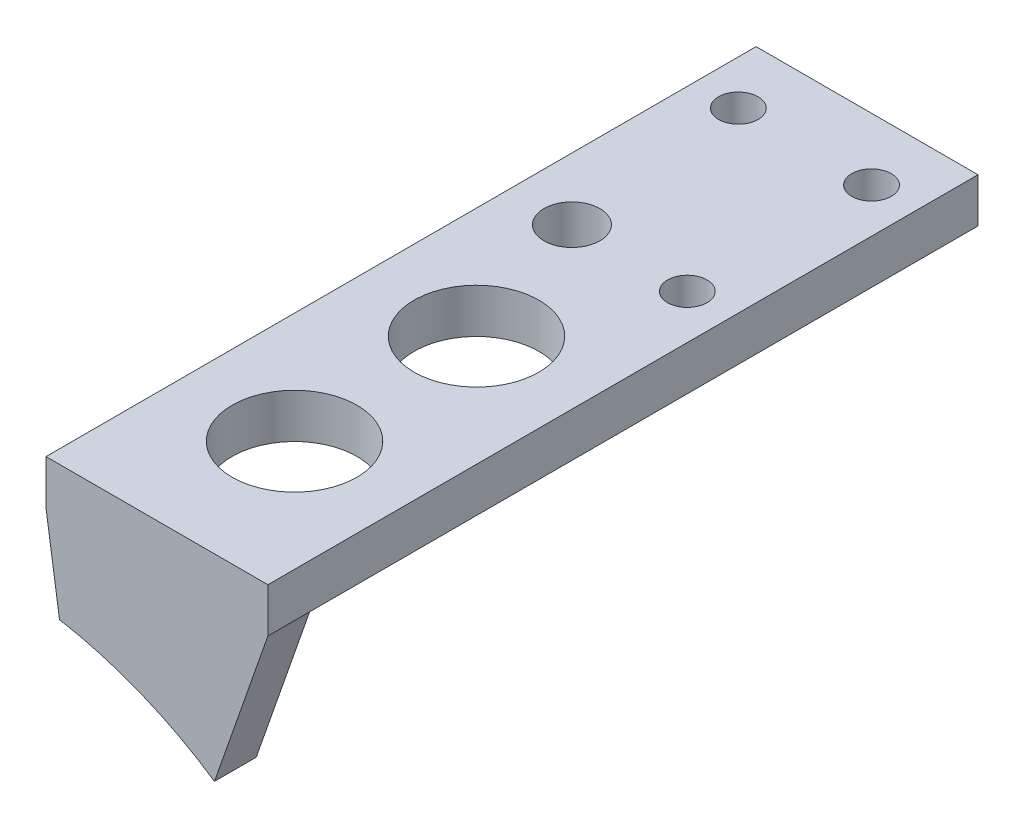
ISO-10303-21;
HEADER;
FILE_DESCRIPTION(('STEP AP214'),'2;1');
FILE_NAME('part.step','',(''),(''),'','','');
FILE_SCHEMA(('AUTOMOTIVE_DESIGN { 1 0 10303 214 1 1 1 1 }'));
ENDSEC;
DATA;
#1=APPLICATION_CONTEXT('core data for automotive mechanical design processes');
#2=APPLICATION_PROTOCOL_DEFINITION('international standard','automotive_design',2000,#1);
#3=PRODUCT_CONTEXT('',#1,'mechanical');
#4=PRODUCT('Part','Part','',(#3));
#5=PRODUCT_RELATED_PRODUCT_CATEGORY('part','',(#4));
#6=PRODUCT_DEFINITION_FORMATION('','',#4);
#7=PRODUCT_DEFINITION_CONTEXT('part definition',#1,'design');
#8=PRODUCT_DEFINITION('design','',#6,#7);
#9=PRODUCT_DEFINITION_SHAPE('','',#8);
#10=(LENGTH_UNIT() NAMED_UNIT(*) SI_UNIT(.MILLI.,.METRE.));
#11=(NAMED_UNIT(*) PLANE_ANGLE_UNIT() SI_UNIT($,.RADIAN.));
#12=(NAMED_UNIT(*) SI_UNIT($,.STERADIAN.) SOLID_ANGLE_UNIT());
#13=UNCERTAINTY_MEASURE_WITH_UNIT(LENGTH_MEASURE(1.E-05),#10,'distance_accuracy_value','');
#14=(GEOMETRIC_REPRESENTATION_CONTEXT(3) GLOBAL_UNCERTAINTY_ASSIGNED_CONTEXT((#13)) GLOBAL_UNIT_ASSIGNED_CONTEXT((#10,
#11,#12)) REPRESENTATION_CONTEXT('',''));
#15=CARTESIAN_POINT('',(0.,0.,0.));
#16=DIRECTION('',(0.,0.,1.));
#17=DIRECTION('',(1.,0.,0.));
#18=AXIS2_PLACEMENT_3D('',#15,#16,#17);
#19=CARTESIAN_POINT('',(-1.88392375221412,12.5594916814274,1.19379999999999));
#20=DIRECTION('',(0.988936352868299,0.148340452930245,0.));
#21=DIRECTION('',(-0.148340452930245,0.988936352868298,0.));
#22=AXIS2_PLACEMENT_3D('',#19,#20,#21);
#23=PLANE('',#22);
#24=DIRECTION('',(0.148340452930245,-0.988936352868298,0.));
#25=VECTOR('',#24,1.);
#26=CARTESIAN_POINT('',(-1.88392375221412,12.5594916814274,-1.19379999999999));
#27=LINE('',#26,#25);
#28=CARTESIAN_POINT('',(-3.81000000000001,25.4,-1.19379999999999));
#29=VERTEX_POINT('',#28);
#30=CARTESIAN_POINT('',(-3.03657,20.2438,-1.19380000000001));
#31=VERTEX_POINT('',#30);
#32=EDGE_CURVE('E137',#29,#31,#27,.T.);
#33=ORIENTED_EDGE('',*,*,#32,.T.);
#34=DIRECTION('',(0.,0.,1.));
#35=VECTOR('',#34,1.);
#36=CARTESIAN_POINT('',(-3.03657,20.2438,-39.4462250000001));
#37=LINE('',#36,#35);
#38=CARTESIAN_POINT('',(-3.03657,20.2438,1.19379999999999));
#39=VERTEX_POINT('',#38);
#40=EDGE_CURVE('E61',#31,#39,#37,.T.);
#41=ORIENTED_EDGE('',*,*,#40,.T.);
#42=DIRECTION('',(0.148340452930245,-0.988936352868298,0.));
#43=VECTOR('',#42,1.);
#44=CARTESIAN_POINT('',(-1.88392375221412,12.5594916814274,1.19379999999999));
#45=LINE('',#44,#43);
#46=CARTESIAN_POINT('',(-3.81000000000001,25.4,1.19379999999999));
#47=VERTEX_POINT('',#46);
#48=EDGE_CURVE('E118',#47,#39,#45,.T.);
#49=ORIENTED_EDGE('',*,*,#48,.F.);
#50=DIRECTION('',(0.,0.,-1.));
#51=VECTOR('',#50,1.);
#52=CARTESIAN_POINT('',(-3.81000000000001,25.4,1.19379999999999));
#53=LINE('',#52,#51);
#54=EDGE_CURVE('E51',#47,#29,#53,.T.);
#55=ORIENTED_EDGE('',*,*,#54,.T.);
#56=EDGE_LOOP('',(#33,#41,#49,#55));
#57=FACE_BOUND('',#56,.T.);
#58=ADVANCED_FACE('F43',(#57),#23,.F.);
#59=CARTESIAN_POINT('',(4.19545039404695,11.9870011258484,1.19379999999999));
#60=DIRECTION('',(-0.943858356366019,0.330350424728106,0.));
#61=DIRECTION('',(-0.330350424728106,-0.943858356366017,0.));
#62=AXIS2_PLACEMENT_3D('',#59,#60,#61);
#63=PLANE('',#62);
#64=DIRECTION('',(0.330350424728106,0.943858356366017,0.));
#65=VECTOR('',#64,1.);
#66=CARTESIAN_POINT('',(4.19545039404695,11.9870011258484,1.19379999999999));
#67=LINE('',#66,#65);
#68=CARTESIAN_POINT('',(5.83184000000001,16.6624,1.19379999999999));
#69=VERTEX_POINT('',#68);
#70=CARTESIAN_POINT('',(8.89,25.4,1.19379999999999));
#71=VERTEX_POINT('',#70);
#72=EDGE_CURVE('E70',#69,#71,#67,.T.);
#73=ORIENTED_EDGE('',*,*,#72,.F.);
#74=DIRECTION('',(0.,0.,1.));
#75=VECTOR('',#74,1.);
#76=CARTESIAN_POINT('',(5.83184000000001,16.6624,-39.4462250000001));
#77=LINE('',#76,#75);
#78=CARTESIAN_POINT('',(5.83184000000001,16.6624,-1.19380000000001));
#79=VERTEX_POINT('',#78);
#80=EDGE_CURVE('E109',#69,#79,#77,.F.);
#81=ORIENTED_EDGE('',*,*,#80,.T.);
#82=DIRECTION('',(0.330350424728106,0.943858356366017,0.));
#83=VECTOR('',#82,1.);
#84=CARTESIAN_POINT('',(4.19545039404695,11.9870011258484,-1.19379999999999));
#85=LINE('',#84,#83);
#86=CARTESIAN_POINT('',(8.89,25.4,-1.19379999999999));
#87=VERTEX_POINT('',#86);
#88=EDGE_CURVE('E129',#79,#87,#85,.T.);
#89=ORIENTED_EDGE('',*,*,#88,.T.);
#90=DIRECTION('',(0.,0.,-1.));
#91=VECTOR('',#90,1.);
#92=CARTESIAN_POINT('',(8.89,25.4,1.19379999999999));
#93=LINE('',#92,#91);
#94=EDGE_CURVE('E122',#71,#87,#93,.T.);
#95=ORIENTED_EDGE('',*,*,#94,.F.);
#96=EDGE_LOOP('',(#73,#81,#89,#95));
#97=FACE_BOUND('',#96,.T.);
#98=ADVANCED_FACE('F120',(#97),#63,.F.);
#99=CARTESIAN_POINT('',(0.,0.,1.19379999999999));
#100=DIRECTION('',(0.,0.,1.));
#101=DIRECTION('',(1.,0.,0.));
#102=AXIS2_PLACEMENT_3D('',#99,#100,#101);
#103=PLANE('',#102);
#104=CARTESIAN_POINT('',(-6.97304437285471,-2.27472058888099,1.19379999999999));
#105=DIRECTION('',(0.,0.,1.));
#106=DIRECTION('',(1.,0.,0.));
#107=AXIS2_PLACEMENT_3D('',#104,#105,#106);
#108=CIRCLE('',#107,22.86);
#109=EDGE_CURVE('E111',#69,#39,#108,.T.);
#110=ORIENTED_EDGE('',*,*,#109,.F.);
#111=ORIENTED_EDGE('',*,*,#72,.T.);
#112=DIRECTION('',(0.,-1.,0.));
#113=VECTOR('',#112,1.);
#114=CARTESIAN_POINT('',(8.89,27.94,1.19379999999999));
#115=LINE('',#114,#113);
#116=CARTESIAN_POINT('',(8.89,27.94,1.19379999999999));
#117=VERTEX_POINT('',#116);
#118=EDGE_CURVE('E155',#117,#71,#115,.T.);
#119=ORIENTED_EDGE('',*,*,#118,.F.);
#120=DIRECTION('',(1.,0.,0.));
#121=VECTOR('',#120,1.);
#122=CARTESIAN_POINT('',(8.89,27.94,1.19379999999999));
#123=LINE('',#122,#121);
#124=CARTESIAN_POINT('',(-3.81000000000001,27.94,1.19379999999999));
#125=VERTEX_POINT('',#124);
#126=EDGE_CURVE('E158',#125,#117,#123,.T.);
#127=ORIENTED_EDGE('',*,*,#126,.F.);
#128=DIRECTION('',(0.,-1.,0.));
#129=VECTOR('',#128,1.);
#130=CARTESIAN_POINT('',(-3.81000000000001,27.94,1.19379999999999));
#131=LINE('',#130,#129);
#132=EDGE_CURVE('E157',#125,#47,#131,.T.);
#133=ORIENTED_EDGE('',*,*,#132,.T.);
#134=ORIENTED_EDGE('',*,*,#48,.T.);
#135=EDGE_LOOP('',(#110,#111,#119,#127,#133,#134));
#136=FACE_BOUND('',#135,.T.);
#137=ADVANCED_FACE('F116',(#136),#103,.T.);
#138=CARTESIAN_POINT('',(0.,0.,-1.19379999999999));
#139=DIRECTION('',(0.,0.,1.));
#140=DIRECTION('',(1.,0.,0.));
#141=AXIS2_PLACEMENT_3D('',#138,#139,#140);
#142=PLANE('',#141);
#143=ORIENTED_EDGE('',*,*,#88,.F.);
#144=CARTESIAN_POINT('',(-6.97304437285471,-2.27472058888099,-1.19379999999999));
#145=DIRECTION('',(0.,0.,1.));
#146=DIRECTION('',(1.,0.,0.));
#147=AXIS2_PLACEMENT_3D('',#144,#145,#146);
#148=CIRCLE('',#147,22.86);
#149=EDGE_CURVE('E11',#79,#31,#148,.T.);
#150=ORIENTED_EDGE('',*,*,#149,.T.);
#151=ORIENTED_EDGE('',*,*,#32,.F.);
#152=DIRECTION('',(-1.,0.,0.));
#153=VECTOR('',#152,1.);
#154=CARTESIAN_POINT('',(-3.81000000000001,25.4,-1.19379999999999));
#155=LINE('',#154,#153);
#156=EDGE_CURVE('E133',#87,#29,#155,.T.);
#157=ORIENTED_EDGE('',*,*,#156,.F.);
#158=EDGE_LOOP('',(#143,#150,#151,#157));
#159=FACE_BOUND('',#158,.T.);
#160=ADVANCED_FACE('F290',(#159),#142,.F.);
#161=CARTESIAN_POINT('',(8.89,25.4,-39.4462000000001));
#162=DIRECTION('',(0.,1.,0.));
#163=DIRECTION('',(0.,0.,1.));
#164=AXIS2_PLACEMENT_3D('',#161,#162,#163);
#165=PLANE('',#164);
#166=CARTESIAN_POINT('',(2.54,25.4,-6.6802));
#167=DIRECTION('',(0.,1.,0.));
#168=DIRECTION('',(0.,0.,1.));
#169=AXIS2_PLACEMENT_3D('',#166,#167,#168);
#170=CIRCLE('',#169,3.571875);
#171=CARTESIAN_POINT('',(2.54,25.4,-3.10832499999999));
#172=VERTEX_POINT('',#171);
#173=EDGE_CURVE('E257',#172,#172,#170,.T.);
#174=ORIENTED_EDGE('',*,*,#173,.T.);
#175=EDGE_LOOP('',(#174));
#176=FACE_BOUND('',#175,.T.);
#177=CARTESIAN_POINT('',(2.54,25.4,-17.0942));
#178=DIRECTION('',(0.,1.,0.));
#179=DIRECTION('',(0.,0.,1.));
#180=AXIS2_PLACEMENT_3D('',#177,#178,#179);
#181=CIRCLE('',#180,3.571875);
#182=CARTESIAN_POINT('',(2.54,25.4,-13.522325));
#183=VERTEX_POINT('',#182);
#184=EDGE_CURVE('E249',#183,#183,#181,.T.);
#185=ORIENTED_EDGE('',*,*,#184,.T.);
#186=EDGE_LOOP('',(#185));
#187=FACE_BOUND('',#186,.T.);
#188=CARTESIAN_POINT('',(6.35000000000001,25.4,-35.8902));
#189=DIRECTION('',(0.,1.,0.));
#190=DIRECTION('',(0.,0.,1.));
#191=AXIS2_PLACEMENT_3D('',#188,#189,#190);
#192=CIRCLE('',#191,1.13029999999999);
#193=CARTESIAN_POINT('',(6.35000000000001,25.4,-34.7599000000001));
#194=VERTEX_POINT('',#193);
#195=EDGE_CURVE('E242',#194,#194,#192,.T.);
#196=ORIENTED_EDGE('',*,*,#195,.T.);
#197=EDGE_LOOP('',(#196));
#198=FACE_BOUND('',#197,.T.);
#199=CARTESIAN_POINT('',(-1.27000000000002,25.4,-35.8902));
#200=DIRECTION('',(0.,1.,0.));
#201=DIRECTION('',(0.,0.,1.));
#202=AXIS2_PLACEMENT_3D('',#199,#200,#201);
#203=CIRCLE('',#202,1.13029999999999);
#204=CARTESIAN_POINT('',(-1.27000000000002,25.4,-34.7599000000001));
#205=VERTEX_POINT('',#204);
#206=EDGE_CURVE('E184',#205,#205,#203,.T.);
#207=ORIENTED_EDGE('',*,*,#206,.T.);
#208=EDGE_LOOP('',(#207));
#209=FACE_BOUND('',#208,.T.);
#210=CARTESIAN_POINT('',(6.35000000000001,25.4,-25.3492));
#211=DIRECTION('',(0.,1.,0.));
#212=DIRECTION('',(0.,0.,1.));
#213=AXIS2_PLACEMENT_3D('',#210,#211,#212);
#214=CIRCLE('',#213,1.13029999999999);
#215=CARTESIAN_POINT('',(6.35000000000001,25.4,-24.2189000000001));
#216=VERTEX_POINT('',#215);
#217=EDGE_CURVE('E233',#216,#216,#214,.T.);
#218=ORIENTED_EDGE('',*,*,#217,.T.);
#219=EDGE_LOOP('',(#218));
#220=FACE_BOUND('',#219,.T.);
#221=CARTESIAN_POINT('',(-0.253999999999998,25.4,-25.3492));
#222=DIRECTION('',(0.,1.,0.));
#223=DIRECTION('',(0.,0.,1.));
#224=AXIS2_PLACEMENT_3D('',#221,#222,#223);
#225=CIRCLE('',#224,1.6002);
#226=CARTESIAN_POINT('',(-0.253999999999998,25.4,-23.749));
#227=VERTEX_POINT('',#226);
#228=EDGE_CURVE('E180',#227,#227,#225,.T.);
#229=ORIENTED_EDGE('',*,*,#228,.T.);
#230=EDGE_LOOP('',(#229));
#231=FACE_BOUND('',#230,.T.);
#232=DIRECTION('',(0.,0.,-1.));
#233=VECTOR('',#232,1.);
#234=CARTESIAN_POINT('',(8.89,25.4,1.19379999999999));
#235=LINE('',#234,#233);
#236=CARTESIAN_POINT('',(8.89,25.4,-39.4462000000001));
#237=VERTEX_POINT('',#236);
#238=EDGE_CURVE('E149',#87,#237,#235,.T.);
#239=ORIENTED_EDGE('',*,*,#238,.F.);
#240=ORIENTED_EDGE('',*,*,#156,.T.);
#241=DIRECTION('',(0.,0.,1.));
#242=VECTOR('',#241,1.);
#243=CARTESIAN_POINT('',(-3.81000000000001,25.4,1.19379999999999));
#244=LINE('',#243,#242);
#245=CARTESIAN_POINT('',(-3.81000000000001,25.4,-39.4462000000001));
#246=VERTEX_POINT('',#245);
#247=EDGE_CURVE('E142',#246,#29,#244,.T.);
#248=ORIENTED_EDGE('',*,*,#247,.F.);
#249=DIRECTION('',(-1.,0.,0.));
#250=VECTOR('',#249,1.);
#251=CARTESIAN_POINT('',(8.89,25.4,-39.4462000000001));
#252=LINE('',#251,#250);
#253=EDGE_CURVE('E148',#237,#246,#252,.T.);
#254=ORIENTED_EDGE('',*,*,#253,.F.);
#255=EDGE_LOOP('',(#239,#240,#248,#254));
#256=FACE_BOUND('',#255,.T.);
#257=ADVANCED_FACE('F182',(#176,#187,#198,#209,#220,#231,#256),#165,.F.);
#258=CARTESIAN_POINT('',(8.89,27.94,1.19379999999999));
#259=DIRECTION('',(-1.,0.,0.));
#260=DIRECTION('',(0.,0.,1.));
#261=AXIS2_PLACEMENT_3D('',#258,#259,#260);
#262=PLANE('',#261);
#263=ORIENTED_EDGE('',*,*,#94,.T.);
#264=ORIENTED_EDGE('',*,*,#238,.T.);
#265=DIRECTION('',(0.,-1.,0.));
#266=VECTOR('',#265,1.);
#267=CARTESIAN_POINT('',(8.89000000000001,27.94,-39.4462000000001));
#268=LINE('',#267,#266);
#269=CARTESIAN_POINT('',(8.89000000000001,27.94,-39.4462000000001));
#270=VERTEX_POINT('',#269);
#271=EDGE_CURVE('E138',#270,#237,#268,.T.);
#272=ORIENTED_EDGE('',*,*,#271,.F.);
#273=DIRECTION('',(0.,0.,-1.));
#274=VECTOR('',#273,1.);
#275=CARTESIAN_POINT('',(8.89,27.94,1.19379999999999));
#276=LINE('',#275,#274);
#277=EDGE_CURVE('E147',#117,#270,#276,.T.);
#278=ORIENTED_EDGE('',*,*,#277,.F.);
#279=ORIENTED_EDGE('',*,*,#118,.T.);
#280=EDGE_LOOP('',(#263,#264,#272,#278,#279));
#281=FACE_BOUND('',#280,.T.);
#282=ADVANCED_FACE('F176',(#281),#262,.F.);
#283=CARTESIAN_POINT('',(8.89000000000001,27.94,-39.4462000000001));
#284=DIRECTION('',(0.,0.,1.));
#285=DIRECTION('',(1.,0.,0.));
#286=AXIS2_PLACEMENT_3D('',#283,#284,#285);
#287=PLANE('',#286);
#288=ORIENTED_EDGE('',*,*,#253,.T.);
#289=DIRECTION('',(0.,-1.,0.));
#290=VECTOR('',#289,1.);
#291=CARTESIAN_POINT('',(-3.81000000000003,27.94,-39.4462000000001));
#292=LINE('',#291,#290);
#293=CARTESIAN_POINT('',(-3.81000000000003,27.94,-39.4462000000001));
#294=VERTEX_POINT('',#293);
#295=EDGE_CURVE('E160',#294,#246,#292,.T.);
#296=ORIENTED_EDGE('',*,*,#295,.F.);
#297=DIRECTION('',(-1.,0.,0.));
#298=VECTOR('',#297,1.);
#299=CARTESIAN_POINT('',(8.89000000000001,27.94,-39.4462000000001));
#300=LINE('',#299,#298);
#301=EDGE_CURVE('E172',#270,#294,#300,.T.);
#302=ORIENTED_EDGE('',*,*,#301,.F.);
#303=ORIENTED_EDGE('',*,*,#271,.T.);
#304=EDGE_LOOP('',(#288,#296,#302,#303));
#305=FACE_BOUND('',#304,.T.);
#306=ADVANCED_FACE('F169',(#305),#287,.F.);
#307=CARTESIAN_POINT('',(-3.81000000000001,27.94,1.19379999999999));
#308=DIRECTION('',(1.,0.,0.));
#309=DIRECTION('',(0.,0.,-1.));
#310=AXIS2_PLACEMENT_3D('',#307,#308,#309);
#311=PLANE('',#310);
#312=ORIENTED_EDGE('',*,*,#247,.T.);
#313=ORIENTED_EDGE('',*,*,#54,.F.);
#314=ORIENTED_EDGE('',*,*,#132,.F.);
#315=DIRECTION('',(0.,0.,1.));
#316=VECTOR('',#315,1.);
#317=CARTESIAN_POINT('',(-3.81000000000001,27.94,1.19379999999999));
#318=LINE('',#317,#316);
#319=EDGE_CURVE('E212',#294,#125,#318,.T.);
#320=ORIENTED_EDGE('',*,*,#319,.F.);
#321=ORIENTED_EDGE('',*,*,#295,.T.);
#322=EDGE_LOOP('',(#312,#313,#314,#320,#321));
#323=FACE_BOUND('',#322,.T.);
#324=ADVANCED_FACE('F210',(#323),#311,.F.);
#325=CARTESIAN_POINT('',(8.89000000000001,27.94,-39.4462000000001));
#326=DIRECTION('',(0.,1.,0.));
#327=DIRECTION('',(0.,0.,1.));
#328=AXIS2_PLACEMENT_3D('',#325,#326,#327);
#329=PLANE('',#328);
#330=CARTESIAN_POINT('',(2.54000000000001,27.94,-6.6802));
#331=DIRECTION('',(0.,1.,0.));
#332=DIRECTION('',(0.,0.,1.));
#333=AXIS2_PLACEMENT_3D('',#330,#331,#332);
#334=CIRCLE('',#333,3.571875);
#335=CARTESIAN_POINT('',(2.54000000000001,27.94,-3.10832499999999));
#336=VERTEX_POINT('',#335);
#337=EDGE_CURVE('E192',#336,#336,#334,.T.);
#338=ORIENTED_EDGE('',*,*,#337,.F.);
#339=EDGE_LOOP('',(#338));
#340=FACE_BOUND('',#339,.T.);
#341=CARTESIAN_POINT('',(2.54000000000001,27.94,-17.0942));
#342=DIRECTION('',(0.,1.,0.));
#343=DIRECTION('',(0.,0.,1.));
#344=AXIS2_PLACEMENT_3D('',#341,#342,#343);
#345=CIRCLE('',#344,3.571875);
#346=CARTESIAN_POINT('',(2.54000000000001,27.94,-13.522325));
#347=VERTEX_POINT('',#346);
#348=EDGE_CURVE('E253',#347,#347,#345,.T.);
#349=ORIENTED_EDGE('',*,*,#348,.F.);
#350=EDGE_LOOP('',(#349));
#351=FACE_BOUND('',#350,.T.);
#352=CARTESIAN_POINT('',(6.35000000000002,27.94,-35.8902));
#353=DIRECTION('',(0.,1.,0.));
#354=DIRECTION('',(0.,0.,1.));
#355=AXIS2_PLACEMENT_3D('',#352,#353,#354);
#356=CIRCLE('',#355,1.13029999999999);
#357=CARTESIAN_POINT('',(6.35000000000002,27.94,-34.7599000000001));
#358=VERTEX_POINT('',#357);
#359=EDGE_CURVE('E246',#358,#358,#356,.T.);
#360=ORIENTED_EDGE('',*,*,#359,.F.);
#361=EDGE_LOOP('',(#360));
#362=FACE_BOUND('',#361,.T.);
#363=CARTESIAN_POINT('',(-1.27000000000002,27.94,-35.8902));
#364=DIRECTION('',(0.,1.,0.));
#365=DIRECTION('',(0.,0.,1.));
#366=AXIS2_PLACEMENT_3D('',#363,#364,#365);
#367=CIRCLE('',#366,1.13029999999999);
#368=CARTESIAN_POINT('',(-1.27000000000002,27.94,-34.7599000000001));
#369=VERTEX_POINT('',#368);
#370=EDGE_CURVE('E188',#369,#369,#367,.T.);
#371=ORIENTED_EDGE('',*,*,#370,.F.);
#372=EDGE_LOOP('',(#371));
#373=FACE_BOUND('',#372,.T.);
#374=CARTESIAN_POINT('',(6.35000000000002,27.94,-25.3492));
#375=DIRECTION('',(0.,1.,0.));
#376=DIRECTION('',(0.,0.,1.));
#377=AXIS2_PLACEMENT_3D('',#374,#375,#376);
#378=CIRCLE('',#377,1.13029999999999);
#379=CARTESIAN_POINT('',(6.35000000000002,27.94,-24.2189000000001));
#380=VERTEX_POINT('',#379);
#381=EDGE_CURVE('E187',#380,#380,#378,.T.);
#382=ORIENTED_EDGE('',*,*,#381,.F.);
#383=EDGE_LOOP('',(#382));
#384=FACE_BOUND('',#383,.T.);
#385=CARTESIAN_POINT('',(-0.254000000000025,27.94,-25.3492));
#386=DIRECTION('',(0.,1.,0.));
#387=DIRECTION('',(0.,0.,1.));
#388=AXIS2_PLACEMENT_3D('',#385,#386,#387);
#389=CIRCLE('',#388,1.6002);
#390=CARTESIAN_POINT('',(-0.254000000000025,27.94,-23.749));
#391=VERTEX_POINT('',#390);
#392=EDGE_CURVE('E229',#391,#391,#389,.T.);
#393=ORIENTED_EDGE('',*,*,#392,.F.);
#394=EDGE_LOOP('',(#393));
#395=FACE_BOUND('',#394,.T.);
#396=ORIENTED_EDGE('',*,*,#277,.T.);
#397=ORIENTED_EDGE('',*,*,#301,.T.);
#398=ORIENTED_EDGE('',*,*,#319,.T.);
#399=ORIENTED_EDGE('',*,*,#126,.T.);
#400=EDGE_LOOP('',(#396,#397,#398,#399));
#401=FACE_BOUND('',#400,.T.);
#402=ADVANCED_FACE('F268',(#340,#351,#362,#373,#384,#395,#401),#329,.T.);
#403=CARTESIAN_POINT('',(-0.254000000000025,27.94,-25.3492));
#404=DIRECTION('',(0.,1.,0.));
#405=DIRECTION('',(0.,0.,1.));
#406=AXIS2_PLACEMENT_3D('',#403,#404,#405);
#407=CYLINDRICAL_SURFACE('',#406,1.6002);
#408=ORIENTED_EDGE('',*,*,#392,.T.);
#409=EDGE_LOOP('',(#408));
#410=FACE_BOUND('',#409,.T.);
#411=ORIENTED_EDGE('',*,*,#228,.F.);
#412=EDGE_LOOP('',(#411));
#413=FACE_BOUND('',#412,.T.);
#414=ADVANCED_FACE('F271',(#410,#413),#407,.F.);
#415=CARTESIAN_POINT('',(6.35000000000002,27.94,-25.3492));
#416=DIRECTION('',(0.,1.,0.));
#417=DIRECTION('',(0.,0.,1.));
#418=AXIS2_PLACEMENT_3D('',#415,#416,#417);
#419=CYLINDRICAL_SURFACE('',#418,1.13029999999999);
#420=ORIENTED_EDGE('',*,*,#381,.T.);
#421=EDGE_LOOP('',(#420));
#422=FACE_BOUND('',#421,.T.);
#423=ORIENTED_EDGE('',*,*,#217,.F.);
#424=EDGE_LOOP('',(#423));
#425=FACE_BOUND('',#424,.T.);
#426=ADVANCED_FACE('F285',(#422,#425),#419,.F.);
#427=CARTESIAN_POINT('',(-1.27000000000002,27.94,-35.8902));
#428=DIRECTION('',(0.,1.,0.));
#429=DIRECTION('',(0.,0.,1.));
#430=AXIS2_PLACEMENT_3D('',#427,#428,#429);
#431=CYLINDRICAL_SURFACE('',#430,1.13029999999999);
#432=ORIENTED_EDGE('',*,*,#370,.T.);
#433=EDGE_LOOP('',(#432));
#434=FACE_BOUND('',#433,.T.);
#435=ORIENTED_EDGE('',*,*,#206,.F.);
#436=EDGE_LOOP('',(#435));
#437=FACE_BOUND('',#436,.T.);
#438=ADVANCED_FACE('F330',(#434,#437),#431,.F.);
#439=CARTESIAN_POINT('',(6.35000000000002,27.94,-35.8902));
#440=DIRECTION('',(0.,1.,0.));
#441=DIRECTION('',(0.,0.,1.));
#442=AXIS2_PLACEMENT_3D('',#439,#440,#441);
#443=CYLINDRICAL_SURFACE('',#442,1.13029999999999);
#444=ORIENTED_EDGE('',*,*,#359,.T.);
#445=EDGE_LOOP('',(#444));
#446=FACE_BOUND('',#445,.T.);
#447=ORIENTED_EDGE('',*,*,#195,.F.);
#448=EDGE_LOOP('',(#447));
#449=FACE_BOUND('',#448,.T.);
#450=ADVANCED_FACE('F338',(#446,#449),#443,.F.);
#451=CARTESIAN_POINT('',(2.54000000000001,27.94,-17.0942));
#452=DIRECTION('',(0.,1.,0.));
#453=DIRECTION('',(0.,0.,1.));
#454=AXIS2_PLACEMENT_3D('',#451,#452,#453);
#455=CYLINDRICAL_SURFACE('',#454,3.571875);
#456=ORIENTED_EDGE('',*,*,#348,.T.);
#457=EDGE_LOOP('',(#456));
#458=FACE_BOUND('',#457,.T.);
#459=ORIENTED_EDGE('',*,*,#184,.F.);
#460=EDGE_LOOP('',(#459));
#461=FACE_BOUND('',#460,.T.);
#462=ADVANCED_FACE('F347',(#458,#461),#455,.F.);
#463=CARTESIAN_POINT('',(2.54000000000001,27.94,-6.6802));
#464=DIRECTION('',(0.,1.,0.));
#465=DIRECTION('',(0.,0.,1.));
#466=AXIS2_PLACEMENT_3D('',#463,#464,#465);
#467=CYLINDRICAL_SURFACE('',#466,3.571875);
#468=ORIENTED_EDGE('',*,*,#337,.T.);
#469=EDGE_LOOP('',(#468));
#470=FACE_BOUND('',#469,.T.);
#471=ORIENTED_EDGE('',*,*,#173,.F.);
#472=EDGE_LOOP('',(#471));
#473=FACE_BOUND('',#472,.T.);
#474=ADVANCED_FACE('F265',(#470,#473),#467,.F.);
#475=CARTESIAN_POINT('',(-6.97304437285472,-2.27472058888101,-39.4462250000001));
#476=DIRECTION('',(0.,0.,1.));
#477=DIRECTION('',(1.,0.,0.));
#478=AXIS2_PLACEMENT_3D('',#475,#476,#477);
#479=CYLINDRICAL_SURFACE('',#478,22.86);
#480=ORIENTED_EDGE('',*,*,#149,.F.);
#481=ORIENTED_EDGE('',*,*,#80,.F.);
#482=ORIENTED_EDGE('',*,*,#109,.T.);
#483=ORIENTED_EDGE('',*,*,#40,.F.);
#484=EDGE_LOOP('',(#480,#481,#482,#483));
#485=FACE_BOUND('',#484,.T.);
#486=ADVANCED_FACE('F110',(#485),#479,.F.);
#487=CLOSED_SHELL('',(#58,#98,#137,#160,#257,#282,#306,#324,#402,#414,#426,#438,#450,#462,#474,#486));
#488=MANIFOLD_SOLID_BREP('B2',#487);
#489=ADVANCED_BREP_SHAPE_REPRESENTATION('',(#18,#488),#14);
#490=SHAPE_DEFINITION_REPRESENTATION(#9,#489);
ENDSEC;
END-ISO-10303-21;
